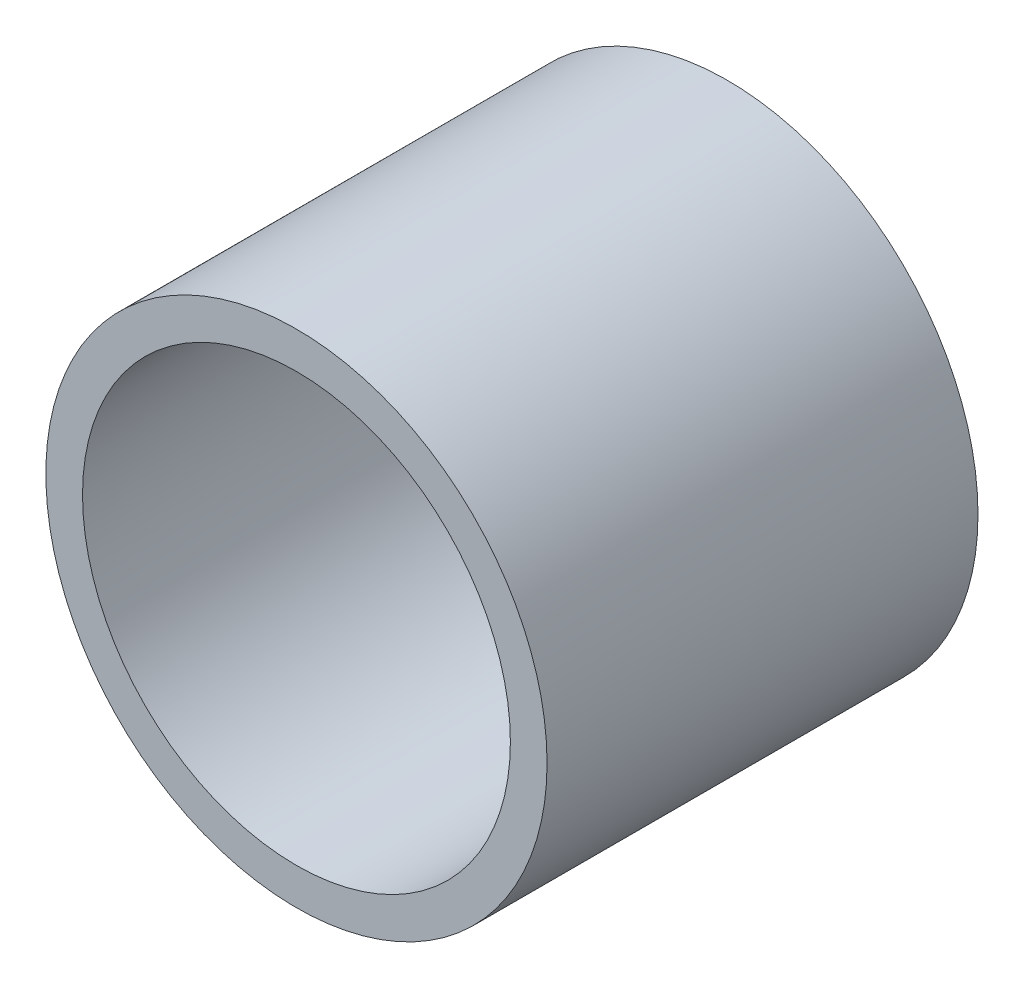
from build123d import *

# Parameters (mm, degrees)
CROQUIS1_R              = 41
CROQUIS1_R_2            = 35
SALIENTE_EXTRUIR1_DEPTH = 70.5


with BuildPart() as part:
    # Croquis1 → Saliente-Extruir1 (new body)
    with BuildSketch(Plane.XY):
        Circle(CROQUIS1_R)
        Circle(CROQUIS1_R_2, mode=Mode.SUBTRACT)
    extrude(amount=SALIENTE_EXTRUIR1_DEPTH)


solid = part.part
